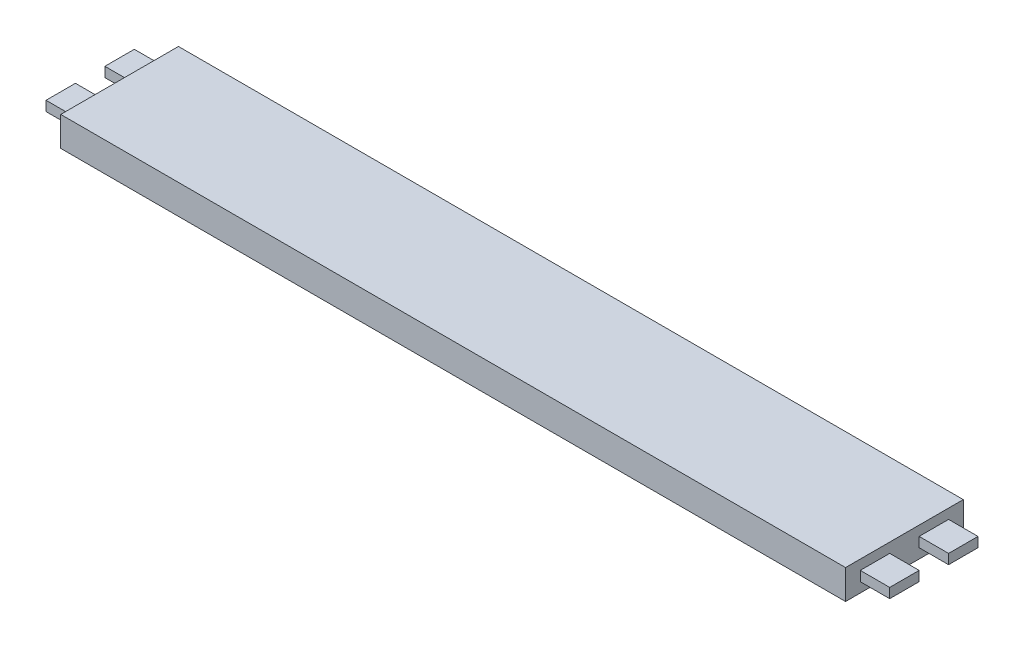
from build123d import *

# Parameters (mm, degrees)
CROQUIS1_W              = 200
CROQUIS1_H              = 60
SALIENTE_EXTRUIR1_DEPTH = 15
CROQUIS2_W              = 15
CROQUIS2_H              = 5
SALIENTE_EXTRUIR2_DEPTH = 15


with BuildPart() as part:
    # Croquis1 → Saliente-Extruir1 (new body)
    with BuildSketch(Plane(origin=(0, 0, 0), x_dir=(1, 0, 0), z_dir=(0, 1, 0))):
        with Locations((100, 30)):
            Rectangle(CROQUIS1_W, CROQUIS1_H)
    saliente_extruir1 = extrude(amount=SALIENTE_EXTRUIR1_DEPTH)

    # Croquis2 → Saliente-Extruir2 (add)
    with BuildSketch(Plane(origin=(200, 0, 0), x_dir=(0, 0, -1), z_dir=(1, 0, 0))):
        with Locations((15, 7.5)):
            Rectangle(CROQUIS2_W, CROQUIS2_H)
        with Locations((45, 7.5)):
            Rectangle(CROQUIS2_W, CROQUIS2_H)
    saliente_extruir2 = extrude(amount=SALIENTE_EXTRUIR2_DEPTH)

    # Simetr_a1: Saliente-Extruir1, Saliente-Extruir2 across plane
    add(saliente_extruir1.mirror(Plane(origin=(0, 15, 0), x_dir=(0, 0, 1), z_dir=(1, 0, 0))))
    add(saliente_extruir2.mirror(Plane(origin=(0, 15, 0), x_dir=(0, 0, 1), z_dir=(1, 0, 0))))


solid = part.part
